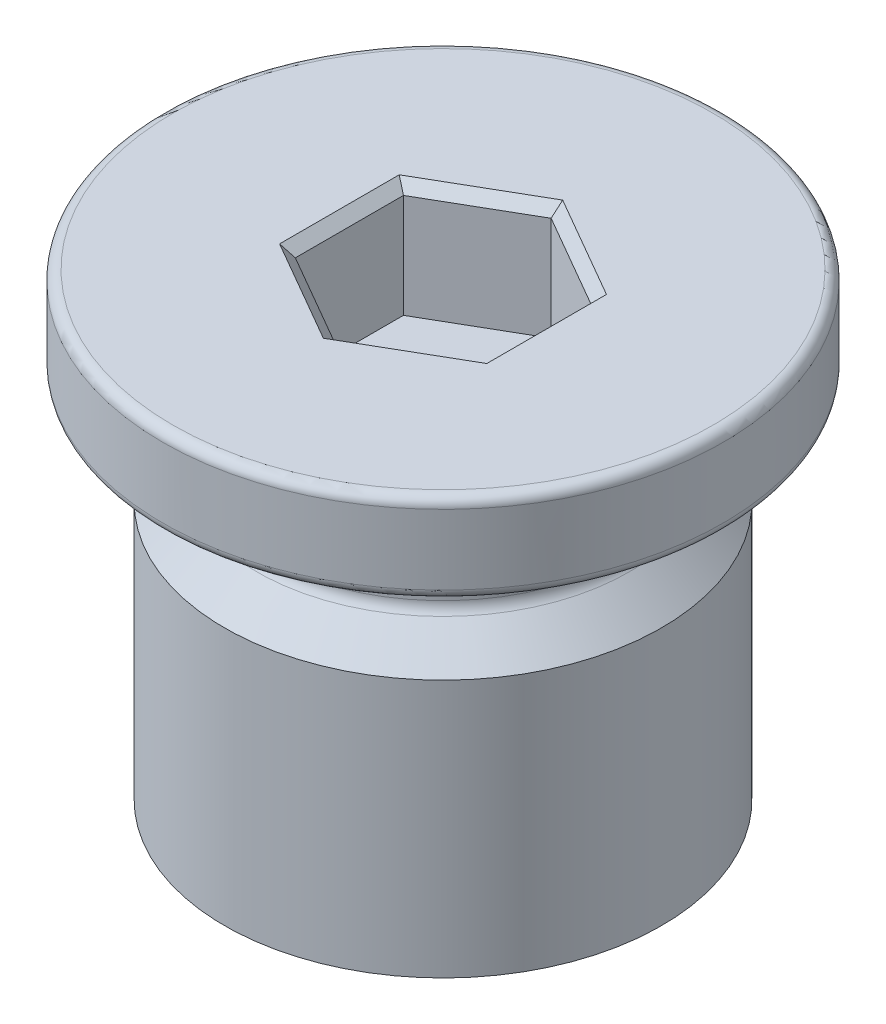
ISO-10303-21;
HEADER;
FILE_DESCRIPTION(('STEP AP214'),'2;1');
FILE_NAME('part.step','',(''),(''),'','','');
FILE_SCHEMA(('AUTOMOTIVE_DESIGN { 1 0 10303 214 1 1 1 1 }'));
ENDSEC;
DATA;
#1=APPLICATION_CONTEXT('core data for automotive mechanical design processes');
#2=APPLICATION_PROTOCOL_DEFINITION('international standard','automotive_design',2000,#1);
#3=PRODUCT_CONTEXT('',#1,'mechanical');
#4=PRODUCT('Part','Part','',(#3));
#5=PRODUCT_RELATED_PRODUCT_CATEGORY('part','',(#4));
#6=PRODUCT_DEFINITION_FORMATION('','',#4);
#7=PRODUCT_DEFINITION_CONTEXT('part definition',#1,'design');
#8=PRODUCT_DEFINITION('design','',#6,#7);
#9=PRODUCT_DEFINITION_SHAPE('','',#8);
#10=(LENGTH_UNIT() NAMED_UNIT(*) SI_UNIT(.MILLI.,.METRE.));
#11=(NAMED_UNIT(*) PLANE_ANGLE_UNIT() SI_UNIT($,.RADIAN.));
#12=(NAMED_UNIT(*) SI_UNIT($,.STERADIAN.) SOLID_ANGLE_UNIT());
#13=UNCERTAINTY_MEASURE_WITH_UNIT(LENGTH_MEASURE(1.E-05),#10,'distance_accuracy_value','');
#14=(GEOMETRIC_REPRESENTATION_CONTEXT(3) GLOBAL_UNCERTAINTY_ASSIGNED_CONTEXT((#13)) GLOBAL_UNIT_ASSIGNED_CONTEXT((#10,
#11,#12)) REPRESENTATION_CONTEXT('',''));
#15=CARTESIAN_POINT('',(0.,0.,0.));
#16=DIRECTION('',(0.,0.,1.));
#17=DIRECTION('',(1.,0.,0.));
#18=AXIS2_PLACEMENT_3D('',#15,#16,#17);
#19=CARTESIAN_POINT('',(5.55625,0.,0.));
#20=DIRECTION('',(0.,-1.,0.));
#21=DIRECTION('',(0.,0.,-1.));
#22=AXIS2_PLACEMENT_3D('',#19,#20,#21);
#23=PLANE('',#22);
#24=CARTESIAN_POINT('',(0.,0.,0.));
#25=DIRECTION('',(0.,-1.,0.));
#26=DIRECTION('',(0.,0.,-1.));
#27=AXIS2_PLACEMENT_3D('',#24,#25,#26);
#28=CIRCLE('',#27,5.55625);
#29=CARTESIAN_POINT('',(0.,0.,-5.55625));
#30=VERTEX_POINT('',#29);
#31=EDGE_CURVE('E156',#30,#30,#28,.T.);
#32=ORIENTED_EDGE('',*,*,#31,.T.);
#33=EDGE_LOOP('',(#32));
#34=FACE_BOUND('',#33,.T.);
#35=ADVANCED_FACE('F36',(#34),#23,.T.);
#36=CARTESIAN_POINT('',(0.,0.,0.));
#37=DIRECTION('',(0.,-1.,0.));
#38=DIRECTION('',(0.,0.,-1.));
#39=AXIS2_PLACEMENT_3D('',#36,#37,#38);
#40=CYLINDRICAL_SURFACE('',#39,5.55625);
#41=CARTESIAN_POINT('',(0.,6.55955000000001,0.));
#42=DIRECTION('',(0.,-1.,0.));
#43=DIRECTION('',(0.,0.,-1.));
#44=AXIS2_PLACEMENT_3D('',#41,#42,#43);
#45=CIRCLE('',#44,5.55625);
#46=CARTESIAN_POINT('',(0.,6.55955000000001,-5.55625));
#47=VERTEX_POINT('',#46);
#48=EDGE_CURVE('E146',#47,#47,#45,.T.);
#49=ORIENTED_EDGE('',*,*,#48,.T.);
#50=EDGE_LOOP('',(#49));
#51=FACE_BOUND('',#50,.T.);
#52=ORIENTED_EDGE('',*,*,#31,.F.);
#53=EDGE_LOOP('',(#52));
#54=FACE_BOUND('',#53,.T.);
#55=ADVANCED_FACE('F241',(#51,#54),#40,.T.);
#56=CARTESIAN_POINT('',(0.,6.55955000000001,0.));
#57=DIRECTION('',(0.,-1.,0.));
#58=DIRECTION('',(0.,0.,-1.));
#59=AXIS2_PLACEMENT_3D('',#56,#57,#58);
#60=CONICAL_SURFACE('',#59,5.55625,0.785398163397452);
#61=CARTESIAN_POINT('',(0.,7.38140768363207,0.));
#62=DIRECTION('',(0.,-1.,0.));
#63=DIRECTION('',(0.,0.,-1.));
#64=AXIS2_PLACEMENT_3D('',#61,#62,#63);
#65=CIRCLE('',#64,4.73439231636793);
#66=CARTESIAN_POINT('',(0.,7.38140768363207,-4.73439231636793));
#67=VERTEX_POINT('',#66);
#68=EDGE_CURVE('E159',#67,#67,#65,.T.);
#69=ORIENTED_EDGE('',*,*,#68,.T.);
#70=EDGE_LOOP('',(#69));
#71=FACE_BOUND('',#70,.T.);
#72=ORIENTED_EDGE('',*,*,#48,.F.);
#73=EDGE_LOOP('',(#72));
#74=FACE_BOUND('',#73,.T.);
#75=ADVANCED_FACE('F246',(#71,#74),#60,.T.);
#76=CARTESIAN_POINT('',(0.,0.,0.));
#77=DIRECTION('',(0.,-1.,0.));
#78=DIRECTION('',(0.,0.,-1.));
#79=AXIS2_PLACEMENT_3D('',#76,#77,#78);
#80=CYLINDRICAL_SURFACE('',#79,4.6228);
#81=CARTESIAN_POINT('',(0.,8.9916,0.));
#82=DIRECTION('',(0.,-1.,0.));
#83=DIRECTION('',(0.,0.,-1.));
#84=AXIS2_PLACEMENT_3D('',#81,#82,#83);
#85=CIRCLE('',#84,4.6228);
#86=CARTESIAN_POINT('',(0.,8.9916,-4.6228));
#87=VERTEX_POINT('',#86);
#88=EDGE_CURVE('E165',#87,#87,#85,.T.);
#89=ORIENTED_EDGE('',*,*,#88,.T.);
#90=EDGE_LOOP('',(#89));
#91=FACE_BOUND('',#90,.T.);
#92=CARTESIAN_POINT('',(0.,7.65081536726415,0.));
#93=DIRECTION('',(0.,-1.,0.));
#94=DIRECTION('',(0.,0.,-1.));
#95=AXIS2_PLACEMENT_3D('',#92,#93,#94);
#96=CIRCLE('',#95,4.6228);
#97=CARTESIAN_POINT('',(0.,7.65081536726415,-4.6228));
#98=VERTEX_POINT('',#97);
#99=EDGE_CURVE('E162',#98,#98,#96,.F.);
#100=ORIENTED_EDGE('',*,*,#99,.T.);
#101=EDGE_LOOP('',(#100));
#102=FACE_BOUND('',#101,.T.);
#103=ADVANCED_FACE('F253',(#91,#102),#80,.T.);
#104=CARTESIAN_POINT('',(4.6228,9.398,0.));
#105=DIRECTION('',(0.,-1.,0.));
#106=DIRECTION('',(0.,0.,-1.));
#107=AXIS2_PLACEMENT_3D('',#104,#105,#106);
#108=PLANE('',#107);
#109=CARTESIAN_POINT('',(0.,9.398,0.));
#110=DIRECTION('',(0.,-1.,0.));
#111=DIRECTION('',(0.,0.,-1.));
#112=AXIS2_PLACEMENT_3D('',#109,#110,#111);
#113=CIRCLE('',#112,6.8707);
#114=CARTESIAN_POINT('',(0.,9.398,-6.8707));
#115=VERTEX_POINT('',#114);
#116=EDGE_CURVE('E180',#115,#115,#113,.T.);
#117=ORIENTED_EDGE('',*,*,#116,.T.);
#118=EDGE_LOOP('',(#117));
#119=FACE_BOUND('',#118,.T.);
#120=CARTESIAN_POINT('',(0.,9.398,0.));
#121=DIRECTION('',(0.,-1.,0.));
#122=DIRECTION('',(0.,0.,-1.));
#123=AXIS2_PLACEMENT_3D('',#120,#121,#122);
#124=CIRCLE('',#123,5.0292);
#125=CARTESIAN_POINT('',(0.,9.398,-5.0292));
#126=VERTEX_POINT('',#125);
#127=EDGE_CURVE('E168',#126,#126,#124,.F.);
#128=ORIENTED_EDGE('',*,*,#127,.T.);
#129=EDGE_LOOP('',(#128));
#130=FACE_BOUND('',#129,.T.);
#131=ADVANCED_FACE('F259',(#119,#130),#108,.T.);
#132=CARTESIAN_POINT('',(0.,0.,0.));
#133=DIRECTION('',(0.,-1.,0.));
#134=DIRECTION('',(0.,0.,-1.));
#135=AXIS2_PLACEMENT_3D('',#132,#133,#134);
#136=CYLINDRICAL_SURFACE('',#135,7.1247);
#137=CARTESIAN_POINT('',(0.,11.43,0.));
#138=DIRECTION('',(0.,1.,0.));
#139=DIRECTION('',(0.,0.,1.));
#140=AXIS2_PLACEMENT_3D('',#137,#138,#139);
#141=CIRCLE('',#140,7.1247);
#142=CARTESIAN_POINT('',(0.,11.43,7.1247));
#143=VERTEX_POINT('',#142);
#144=EDGE_CURVE('E174',#143,#143,#141,.F.);
#145=ORIENTED_EDGE('',*,*,#144,.T.);
#146=EDGE_LOOP('',(#145));
#147=FACE_BOUND('',#146,.T.);
#148=CARTESIAN_POINT('',(0.,9.652,0.));
#149=DIRECTION('',(0.,-1.,0.));
#150=DIRECTION('',(0.,0.,-1.));
#151=AXIS2_PLACEMENT_3D('',#148,#149,#150);
#152=CIRCLE('',#151,7.1247);
#153=CARTESIAN_POINT('',(0.,9.652,-7.1247));
#154=VERTEX_POINT('',#153);
#155=EDGE_CURVE('E171',#154,#154,#152,.F.);
#156=ORIENTED_EDGE('',*,*,#155,.T.);
#157=EDGE_LOOP('',(#156));
#158=FACE_BOUND('',#157,.T.);
#159=ADVANCED_FACE('F263',(#147,#158),#136,.T.);
#160=CARTESIAN_POINT('',(0.,11.684,0.));
#161=DIRECTION('',(0.,1.,0.));
#162=DIRECTION('',(0.,0.,1.));
#163=AXIS2_PLACEMENT_3D('',#160,#161,#162);
#164=PLANE('',#163);
#165=DIRECTION('',(0.866025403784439,0.,0.5));
#166=VECTOR('',#165,1.);
#167=CARTESIAN_POINT('',(2.50825,11.684,-1.59478578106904));
#168=LINE('',#167,#166);
#169=CARTESIAN_POINT('',(0.,11.684,-3.04292459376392));
#170=VERTEX_POINT('',#169);
#171=CARTESIAN_POINT('',(2.63525000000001,11.684,-1.52146229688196));
#172=VERTEX_POINT('',#171);
#173=EDGE_CURVE('E186',#170,#172,#168,.T.);
#174=ORIENTED_EDGE('',*,*,#173,.T.);
#175=DIRECTION('',(0.,0.,1.));
#176=VECTOR('',#175,1.);
#177=CARTESIAN_POINT('',(2.63525,11.684,1.3748153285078));
#178=LINE('',#177,#176);
#179=CARTESIAN_POINT('',(2.63525,11.684,1.52146229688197));
#180=VERTEX_POINT('',#179);
#181=EDGE_CURVE('E196',#172,#180,#178,.T.);
#182=ORIENTED_EDGE('',*,*,#181,.T.);
#183=DIRECTION('',(-0.86602540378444,0.,0.499999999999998));
#184=VECTOR('',#183,1.);
#185=CARTESIAN_POINT('',(0.127000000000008,11.684,2.96960110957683));
#186=LINE('',#185,#184);
#187=CARTESIAN_POINT('',(0.,11.684,3.04292459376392));
#188=VERTEX_POINT('',#187);
#189=EDGE_CURVE('E194',#180,#188,#186,.T.);
#190=ORIENTED_EDGE('',*,*,#189,.T.);
#191=DIRECTION('',(-0.866025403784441,0.,-0.499999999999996));
#192=VECTOR('',#191,1.);
#193=CARTESIAN_POINT('',(-2.50825,11.684,1.59478578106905));
#194=LINE('',#193,#192);
#195=CARTESIAN_POINT('',(-2.63525,11.684,1.52146229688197));
#196=VERTEX_POINT('',#195);
#197=EDGE_CURVE('E192',#188,#196,#194,.T.);
#198=ORIENTED_EDGE('',*,*,#197,.T.);
#199=DIRECTION('',(0.,0.,-1.));
#200=VECTOR('',#199,1.);
#201=CARTESIAN_POINT('',(-2.63525,11.684,-1.3748153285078));
#202=LINE('',#201,#200);
#203=CARTESIAN_POINT('',(-2.63525,11.684,-1.52146229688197));
#204=VERTEX_POINT('',#203);
#205=EDGE_CURVE('E190',#196,#204,#202,.T.);
#206=ORIENTED_EDGE('',*,*,#205,.T.);
#207=DIRECTION('',(0.866025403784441,0.,-0.499999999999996));
#208=VECTOR('',#207,1.);
#209=CARTESIAN_POINT('',(-0.126999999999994,11.684,-2.96960110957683));
#210=LINE('',#209,#208);
#211=EDGE_CURVE('E188',#204,#170,#210,.T.);
#212=ORIENTED_EDGE('',*,*,#211,.T.);
#213=EDGE_LOOP('',(#174,#182,#190,#198,#206,#212));
#214=FACE_BOUND('',#213,.T.);
#215=CARTESIAN_POINT('',(0.,11.684,0.));
#216=DIRECTION('',(0.,1.,0.));
#217=DIRECTION('',(0.,0.,1.));
#218=AXIS2_PLACEMENT_3D('',#215,#216,#217);
#219=CIRCLE('',#218,6.8707);
#220=CARTESIAN_POINT('',(0.,11.684,6.8707));
#221=VERTEX_POINT('',#220);
#222=EDGE_CURVE('E177',#221,#221,#219,.T.);
#223=ORIENTED_EDGE('',*,*,#222,.T.);
#224=EDGE_LOOP('',(#223));
#225=FACE_BOUND('',#224,.T.);
#226=ADVANCED_FACE('F267',(#214,#225),#164,.T.);
#227=CARTESIAN_POINT('',(0.,8.7884,2.74963065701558));
#228=DIRECTION('',(-0.499999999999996,0.,0.866025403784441));
#229=DIRECTION('',(0.866025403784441,0.,0.499999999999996));
#230=AXIS2_PLACEMENT_3D('',#227,#228,#229);
#231=PLANE('',#230);
#232=DIRECTION('',(0.,1.,0.));
#233=VECTOR('',#232,1.);
#234=CARTESIAN_POINT('',(-2.38125,8.7884,1.3748153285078));
#235=LINE('',#234,#233);
#236=CARTESIAN_POINT('',(-2.38125,8.7884,1.3748153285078));
#237=VERTEX_POINT('',#236);
#238=CARTESIAN_POINT('',(-2.38125,11.43,1.3748153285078));
#239=VERTEX_POINT('',#238);
#240=EDGE_CURVE('E144',#237,#239,#235,.T.);
#241=ORIENTED_EDGE('',*,*,#240,.T.);
#242=DIRECTION('',(0.866025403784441,0.,0.499999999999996));
#243=VECTOR('',#242,1.);
#244=CARTESIAN_POINT('',(0.,11.43,2.74963065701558));
#245=LINE('',#244,#243);
#246=CARTESIAN_POINT('',(0.,11.43,2.74963065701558));
#247=VERTEX_POINT('',#246);
#248=EDGE_CURVE('E112',#239,#247,#245,.T.);
#249=ORIENTED_EDGE('',*,*,#248,.T.);
#250=DIRECTION('',(0.,1.,0.));
#251=VECTOR('',#250,1.);
#252=CARTESIAN_POINT('',(0.,8.7884,2.74963065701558));
#253=LINE('',#252,#251);
#254=CARTESIAN_POINT('',(0.,8.7884,2.74963065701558));
#255=VERTEX_POINT('',#254);
#256=EDGE_CURVE('E104',#255,#247,#253,.T.);
#257=ORIENTED_EDGE('',*,*,#256,.F.);
#258=DIRECTION('',(0.866025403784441,0.,0.499999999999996));
#259=VECTOR('',#258,1.);
#260=CARTESIAN_POINT('',(0.,8.7884,2.74963065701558));
#261=LINE('',#260,#259);
#262=EDGE_CURVE('E109',#237,#255,#261,.T.);
#263=ORIENTED_EDGE('',*,*,#262,.F.);
#264=EDGE_LOOP('',(#241,#249,#257,#263));
#265=FACE_BOUND('',#264,.T.);
#266=ADVANCED_FACE('F107',(#265),#231,.F.);
#267=CARTESIAN_POINT('',(-2.38125,8.7884,1.3748153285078));
#268=DIRECTION('',(-1.,0.,0.));
#269=DIRECTION('',(0.,0.,1.));
#270=AXIS2_PLACEMENT_3D('',#267,#268,#269);
#271=PLANE('',#270);
#272=DIRECTION('',(0.,1.,0.));
#273=VECTOR('',#272,1.);
#274=CARTESIAN_POINT('',(-2.38125,8.7884,-1.3748153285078));
#275=LINE('',#274,#273);
#276=CARTESIAN_POINT('',(-2.38125,8.7884,-1.3748153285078));
#277=VERTEX_POINT('',#276);
#278=CARTESIAN_POINT('',(-2.38125,11.43,-1.3748153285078));
#279=VERTEX_POINT('',#278);
#280=EDGE_CURVE('E147',#277,#279,#275,.T.);
#281=ORIENTED_EDGE('',*,*,#280,.T.);
#282=DIRECTION('',(0.,0.,1.));
#283=VECTOR('',#282,1.);
#284=CARTESIAN_POINT('',(-2.38125,11.43,1.3748153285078));
#285=LINE('',#284,#283);
#286=EDGE_CURVE('E202',#279,#239,#285,.T.);
#287=ORIENTED_EDGE('',*,*,#286,.T.);
#288=ORIENTED_EDGE('',*,*,#240,.F.);
#289=DIRECTION('',(0.,0.,1.));
#290=VECTOR('',#289,1.);
#291=CARTESIAN_POINT('',(-2.38125,8.7884,1.3748153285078));
#292=LINE('',#291,#290);
#293=EDGE_CURVE('E116',#277,#237,#292,.T.);
#294=ORIENTED_EDGE('',*,*,#293,.F.);
#295=EDGE_LOOP('',(#281,#287,#288,#294));
#296=FACE_BOUND('',#295,.T.);
#297=ADVANCED_FACE('F205',(#296),#271,.F.);
#298=CARTESIAN_POINT('',(0.,8.7884,-2.74963065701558));
#299=DIRECTION('',(-0.499999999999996,0.,-0.866025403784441));
#300=DIRECTION('',(-0.866025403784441,0.,0.499999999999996));
#301=AXIS2_PLACEMENT_3D('',#298,#299,#300);
#302=PLANE('',#301);
#303=DIRECTION('',(0.,1.,0.));
#304=VECTOR('',#303,1.);
#305=CARTESIAN_POINT('',(0.,8.7884,-2.74963065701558));
#306=LINE('',#305,#304);
#307=CARTESIAN_POINT('',(0.,8.7884,-2.74963065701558));
#308=VERTEX_POINT('',#307);
#309=CARTESIAN_POINT('',(0.,11.43,-2.74963065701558));
#310=VERTEX_POINT('',#309);
#311=EDGE_CURVE('E149',#308,#310,#306,.T.);
#312=ORIENTED_EDGE('',*,*,#311,.T.);
#313=DIRECTION('',(-0.866025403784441,0.,0.499999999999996));
#314=VECTOR('',#313,1.);
#315=CARTESIAN_POINT('',(-2.38125,11.43,-1.3748153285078));
#316=LINE('',#315,#314);
#317=EDGE_CURVE('E43',#310,#279,#316,.T.);
#318=ORIENTED_EDGE('',*,*,#317,.T.);
#319=ORIENTED_EDGE('',*,*,#280,.F.);
#320=DIRECTION('',(-0.866025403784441,0.,0.499999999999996));
#321=VECTOR('',#320,1.);
#322=CARTESIAN_POINT('',(0.,8.7884,-2.74963065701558));
#323=LINE('',#322,#321);
#324=EDGE_CURVE('E141',#308,#277,#323,.T.);
#325=ORIENTED_EDGE('',*,*,#324,.F.);
#326=EDGE_LOOP('',(#312,#318,#319,#325));
#327=FACE_BOUND('',#326,.T.);
#328=ADVANCED_FACE('F231',(#327),#302,.F.);
#329=CARTESIAN_POINT('',(0.,8.7884,-2.74963065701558));
#330=DIRECTION('',(0.5,0.,-0.866025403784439));
#331=DIRECTION('',(-0.866025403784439,0.,-0.5));
#332=AXIS2_PLACEMENT_3D('',#329,#330,#331);
#333=PLANE('',#332);
#334=DIRECTION('',(0.,1.,0.));
#335=VECTOR('',#334,1.);
#336=CARTESIAN_POINT('',(2.38125,8.7884,-1.37481532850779));
#337=LINE('',#336,#335);
#338=CARTESIAN_POINT('',(2.38125,8.7884,-1.37481532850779));
#339=VERTEX_POINT('',#338);
#340=CARTESIAN_POINT('',(2.38125,11.43,-1.37481532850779));
#341=VERTEX_POINT('',#340);
#342=EDGE_CURVE('E151',#339,#341,#337,.T.);
#343=ORIENTED_EDGE('',*,*,#342,.T.);
#344=DIRECTION('',(-0.866025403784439,0.,-0.5));
#345=VECTOR('',#344,1.);
#346=CARTESIAN_POINT('',(0.,11.43,-2.74963065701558));
#347=LINE('',#346,#345);
#348=EDGE_CURVE('E11',#341,#310,#347,.T.);
#349=ORIENTED_EDGE('',*,*,#348,.T.);
#350=ORIENTED_EDGE('',*,*,#311,.F.);
#351=DIRECTION('',(-0.866025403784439,0.,-0.5));
#352=VECTOR('',#351,1.);
#353=CARTESIAN_POINT('',(0.,8.7884,-2.74963065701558));
#354=LINE('',#353,#352);
#355=EDGE_CURVE('E138',#339,#308,#354,.T.);
#356=ORIENTED_EDGE('',*,*,#355,.F.);
#357=EDGE_LOOP('',(#343,#349,#350,#356));
#358=FACE_BOUND('',#357,.T.);
#359=ADVANCED_FACE('F230',(#358),#333,.F.);
#360=CARTESIAN_POINT('',(2.38125,8.7884,1.3748153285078));
#361=DIRECTION('',(1.,0.,0.));
#362=DIRECTION('',(0.,0.,-1.));
#363=AXIS2_PLACEMENT_3D('',#360,#361,#362);
#364=PLANE('',#363);
#365=DIRECTION('',(0.,1.,0.));
#366=VECTOR('',#365,1.);
#367=CARTESIAN_POINT('',(2.38125,8.7884,1.3748153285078));
#368=LINE('',#367,#366);
#369=CARTESIAN_POINT('',(2.38125,8.7884,1.3748153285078));
#370=VERTEX_POINT('',#369);
#371=CARTESIAN_POINT('',(2.38125,11.43,1.3748153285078));
#372=VERTEX_POINT('',#371);
#373=EDGE_CURVE('E115',#370,#372,#368,.T.);
#374=ORIENTED_EDGE('',*,*,#373,.T.);
#375=DIRECTION('',(0.,0.,-1.));
#376=VECTOR('',#375,1.);
#377=CARTESIAN_POINT('',(2.38125,11.43,-1.37481532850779));
#378=LINE('',#377,#376);
#379=EDGE_CURVE('E183',#372,#341,#378,.T.);
#380=ORIENTED_EDGE('',*,*,#379,.T.);
#381=ORIENTED_EDGE('',*,*,#342,.F.);
#382=DIRECTION('',(0.,0.,-1.));
#383=VECTOR('',#382,1.);
#384=CARTESIAN_POINT('',(2.38125,8.7884,1.3748153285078));
#385=LINE('',#384,#383);
#386=EDGE_CURVE('E125',#370,#339,#385,.T.);
#387=ORIENTED_EDGE('',*,*,#386,.F.);
#388=EDGE_LOOP('',(#374,#380,#381,#387));
#389=FACE_BOUND('',#388,.T.);
#390=ADVANCED_FACE('F227',(#389),#364,.F.);
#391=CARTESIAN_POINT('',(0.,8.7884,2.74963065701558));
#392=DIRECTION('',(0.499999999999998,0.,0.86602540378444));
#393=DIRECTION('',(0.86602540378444,0.,-0.499999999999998));
#394=AXIS2_PLACEMENT_3D('',#391,#392,#393);
#395=PLANE('',#394);
#396=ORIENTED_EDGE('',*,*,#256,.T.);
#397=DIRECTION('',(0.86602540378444,0.,-0.499999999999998));
#398=VECTOR('',#397,1.);
#399=CARTESIAN_POINT('',(2.38125,11.43,1.3748153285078));
#400=LINE('',#399,#398);
#401=EDGE_CURVE('E199',#247,#372,#400,.T.);
#402=ORIENTED_EDGE('',*,*,#401,.T.);
#403=ORIENTED_EDGE('',*,*,#373,.F.);
#404=DIRECTION('',(0.86602540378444,0.,-0.499999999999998));
#405=VECTOR('',#404,1.);
#406=CARTESIAN_POINT('',(0.,8.7884,2.74963065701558));
#407=LINE('',#406,#405);
#408=EDGE_CURVE('E119',#255,#370,#407,.T.);
#409=ORIENTED_EDGE('',*,*,#408,.F.);
#410=EDGE_LOOP('',(#396,#402,#403,#409));
#411=FACE_BOUND('',#410,.T.);
#412=ADVANCED_FACE('F120',(#411),#395,.F.);
#413=CARTESIAN_POINT('',(2.38124999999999,8.7884,4.12444598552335));
#414=DIRECTION('',(0.,-1.,0.));
#415=DIRECTION('',(0.,0.,-1.));
#416=AXIS2_PLACEMENT_3D('',#413,#414,#415);
#417=PLANE('',#416);
#418=ORIENTED_EDGE('',*,*,#262,.T.);
#419=ORIENTED_EDGE('',*,*,#408,.T.);
#420=ORIENTED_EDGE('',*,*,#386,.T.);
#421=ORIENTED_EDGE('',*,*,#355,.T.);
#422=ORIENTED_EDGE('',*,*,#324,.T.);
#423=ORIENTED_EDGE('',*,*,#293,.T.);
#424=EDGE_LOOP('',(#418,#419,#420,#421,#422,#423));
#425=FACE_BOUND('',#424,.T.);
#426=ADVANCED_FACE('F127',(#425),#417,.F.);
#427=CARTESIAN_POINT('',(0.,7.65081536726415,0.));
#428=DIRECTION('',(0.,-1.,0.));
#429=DIRECTION('',(0.,0.,-1.));
#430=AXIS2_PLACEMENT_3D('',#427,#428,#429);
#431=TOROIDAL_SURFACE('',#430,5.0038,0.381);
#432=ORIENTED_EDGE('',*,*,#99,.F.);
#433=EDGE_LOOP('',(#432));
#434=FACE_BOUND('',#433,.T.);
#435=ORIENTED_EDGE('',*,*,#68,.F.);
#436=EDGE_LOOP('',(#435));
#437=FACE_BOUND('',#436,.T.);
#438=ADVANCED_FACE('F292',(#434,#437),#431,.F.);
#439=CARTESIAN_POINT('',(0.,8.9916,0.));
#440=DIRECTION('',(0.,-1.,0.));
#441=DIRECTION('',(0.,0.,-1.));
#442=AXIS2_PLACEMENT_3D('',#439,#440,#441);
#443=TOROIDAL_SURFACE('',#442,5.0292,0.4064);
#444=ORIENTED_EDGE('',*,*,#127,.F.);
#445=EDGE_LOOP('',(#444));
#446=FACE_BOUND('',#445,.T.);
#447=ORIENTED_EDGE('',*,*,#88,.F.);
#448=EDGE_LOOP('',(#447));
#449=FACE_BOUND('',#448,.T.);
#450=ADVANCED_FACE('F300',(#446,#449),#443,.F.);
#451=CARTESIAN_POINT('',(0.,11.43,0.));
#452=DIRECTION('',(0.,1.,0.));
#453=DIRECTION('',(0.,0.,1.));
#454=AXIS2_PLACEMENT_3D('',#451,#452,#453);
#455=TOROIDAL_SURFACE('',#454,6.8707,0.254);
#456=ORIENTED_EDGE('',*,*,#222,.F.);
#457=EDGE_LOOP('',(#456));
#458=FACE_BOUND('',#457,.T.);
#459=ORIENTED_EDGE('',*,*,#144,.F.);
#460=EDGE_LOOP('',(#459));
#461=FACE_BOUND('',#460,.T.);
#462=ADVANCED_FACE('F309',(#458,#461),#455,.T.);
#463=CARTESIAN_POINT('',(0.,9.652,0.));
#464=DIRECTION('',(0.,-1.,0.));
#465=DIRECTION('',(0.,0.,-1.));
#466=AXIS2_PLACEMENT_3D('',#463,#464,#465);
#467=TOROIDAL_SURFACE('',#466,6.8707,0.254);
#468=ORIENTED_EDGE('',*,*,#155,.F.);
#469=EDGE_LOOP('',(#468));
#470=FACE_BOUND('',#469,.T.);
#471=ORIENTED_EDGE('',*,*,#116,.F.);
#472=EDGE_LOOP('',(#471));
#473=FACE_BOUND('',#472,.T.);
#474=ADVANCED_FACE('F318',(#470,#473),#467,.T.);
#475=CARTESIAN_POINT('',(-2.38125,11.43,1.3748153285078));
#476=DIRECTION('',(0.707106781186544,0.707106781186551,0.));
#477=DIRECTION('',(-0.707106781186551,0.707106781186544,0.));
#478=AXIS2_PLACEMENT_3D('',#475,#476,#477);
#479=PLANE('',#478);
#480=DIRECTION('',(0.65465367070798,-0.654653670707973,0.37796447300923));
#481=VECTOR('',#480,1.);
#482=CARTESIAN_POINT('',(-1.70089285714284,10.7496428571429,-0.982010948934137));
#483=LINE('',#482,#481);
#484=EDGE_CURVE('E133',#204,#279,#483,.T.);
#485=ORIENTED_EDGE('',*,*,#484,.F.);
#486=ORIENTED_EDGE('',*,*,#205,.F.);
#487=DIRECTION('',(0.65465367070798,-0.654653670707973,-0.37796447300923));
#488=VECTOR('',#487,1.);
#489=CARTESIAN_POINT('',(-1.70089285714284,10.7496428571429,0.982010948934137));
#490=LINE('',#489,#488);
#491=EDGE_CURVE('E130',#239,#196,#490,.F.);
#492=ORIENTED_EDGE('',*,*,#491,.F.);
#493=ORIENTED_EDGE('',*,*,#286,.F.);
#494=EDGE_LOOP('',(#485,#486,#492,#493));
#495=FACE_BOUND('',#494,.T.);
#496=ADVANCED_FACE('F211',(#495),#479,.T.);
#497=CARTESIAN_POINT('',(0.,11.43,2.74963065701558));
#498=DIRECTION('',(0.353553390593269,0.707106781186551,-0.612372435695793));
#499=DIRECTION('',(0.,0.654653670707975,0.755928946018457));
#500=AXIS2_PLACEMENT_3D('',#497,#498,#499);
#501=PLANE('',#500);
#502=ORIENTED_EDGE('',*,*,#491,.T.);
#503=ORIENTED_EDGE('',*,*,#197,.F.);
#504=DIRECTION('',(0.,-0.654653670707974,-0.755928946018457));
#505=VECTOR('',#504,1.);
#506=CARTESIAN_POINT('',(0.,11.43,2.74963065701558));
#507=LINE('',#506,#505);
#508=EDGE_CURVE('E216',#247,#188,#507,.F.);
#509=ORIENTED_EDGE('',*,*,#508,.F.);
#510=ORIENTED_EDGE('',*,*,#248,.F.);
#511=EDGE_LOOP('',(#502,#503,#509,#510));
#512=FACE_BOUND('',#511,.T.);
#513=ADVANCED_FACE('F214',(#512),#501,.T.);
#514=CARTESIAN_POINT('',(0.,11.43,-2.74963065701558));
#515=DIRECTION('',(0.353553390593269,0.707106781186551,0.612372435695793));
#516=DIRECTION('',(0.,-0.654653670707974,0.755928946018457));
#517=AXIS2_PLACEMENT_3D('',#514,#515,#516);
#518=PLANE('',#517);
#519=ORIENTED_EDGE('',*,*,#484,.T.);
#520=ORIENTED_EDGE('',*,*,#317,.F.);
#521=DIRECTION('',(0.,-0.654653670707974,0.755928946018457));
#522=VECTOR('',#521,1.);
#523=CARTESIAN_POINT('',(0.,11.43,-2.74963065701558));
#524=LINE('',#523,#522);
#525=EDGE_CURVE('E220',#170,#310,#524,.T.);
#526=ORIENTED_EDGE('',*,*,#525,.F.);
#527=ORIENTED_EDGE('',*,*,#211,.F.);
#528=EDGE_LOOP('',(#519,#520,#526,#527));
#529=FACE_BOUND('',#528,.T.);
#530=ADVANCED_FACE('F340',(#529),#518,.T.);
#531=CARTESIAN_POINT('',(0.,11.43,2.74963065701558));
#532=DIRECTION('',(-0.35355339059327,0.707106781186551,-0.612372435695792));
#533=DIRECTION('',(0.,0.654653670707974,0.755928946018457));
#534=AXIS2_PLACEMENT_3D('',#531,#532,#533);
#535=PLANE('',#534);
#536=ORIENTED_EDGE('',*,*,#508,.T.);
#537=ORIENTED_EDGE('',*,*,#189,.F.);
#538=DIRECTION('',(-0.654653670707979,-0.654653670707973,-0.377964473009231));
#539=VECTOR('',#538,1.);
#540=CARTESIAN_POINT('',(2.38125,11.43,1.3748153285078));
#541=LINE('',#540,#539);
#542=EDGE_CURVE('E224',#372,#180,#541,.F.);
#543=ORIENTED_EDGE('',*,*,#542,.F.);
#544=ORIENTED_EDGE('',*,*,#401,.F.);
#545=EDGE_LOOP('',(#536,#537,#543,#544));
#546=FACE_BOUND('',#545,.T.);
#547=ADVANCED_FACE('F223',(#546),#535,.T.);
#548=CARTESIAN_POINT('',(0.,11.43,-2.74963065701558));
#549=DIRECTION('',(-0.353553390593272,0.707106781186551,0.612372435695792));
#550=DIRECTION('',(0.,-0.654653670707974,0.755928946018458));
#551=AXIS2_PLACEMENT_3D('',#548,#549,#550);
#552=PLANE('',#551);
#553=ORIENTED_EDGE('',*,*,#525,.T.);
#554=ORIENTED_EDGE('',*,*,#348,.F.);
#555=DIRECTION('',(0.654653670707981,0.654653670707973,-0.377964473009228));
#556=VECTOR('',#555,1.);
#557=CARTESIAN_POINT('',(1.70089285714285,10.7496428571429,-0.98201094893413));
#558=LINE('',#557,#556);
#559=EDGE_CURVE('E453',#172,#341,#558,.F.);
#560=ORIENTED_EDGE('',*,*,#559,.F.);
#561=ORIENTED_EDGE('',*,*,#173,.F.);
#562=EDGE_LOOP('',(#553,#554,#560,#561));
#563=FACE_BOUND('',#562,.T.);
#564=ADVANCED_FACE('F354',(#563),#552,.T.);
#565=CARTESIAN_POINT('',(2.38125,11.43,1.3748153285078));
#566=DIRECTION('',(-0.707106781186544,0.707106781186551,0.));
#567=DIRECTION('',(-0.707106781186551,-0.707106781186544,0.));
#568=AXIS2_PLACEMENT_3D('',#565,#566,#567);
#569=PLANE('',#568);
#570=ORIENTED_EDGE('',*,*,#542,.T.);
#571=ORIENTED_EDGE('',*,*,#181,.F.);
#572=ORIENTED_EDGE('',*,*,#559,.T.);
#573=ORIENTED_EDGE('',*,*,#379,.F.);
#574=EDGE_LOOP('',(#570,#571,#572,#573));
#575=FACE_BOUND('',#574,.T.);
#576=ADVANCED_FACE('F361',(#575),#569,.T.);
#577=CLOSED_SHELL('',(#35,#55,#75,#103,#131,#159,#226,#266,#297,#328,#359,#390,#412,#426,#438,
#450,#462,#474,#496,#513,#530,#547,#564,#576));
#578=MANIFOLD_SOLID_BREP('B2',#577);
#579=ADVANCED_BREP_SHAPE_REPRESENTATION('',(#18,#578),#14);
#580=SHAPE_DEFINITION_REPRESENTATION(#9,#579);
ENDSEC;
END-ISO-10303-21;
